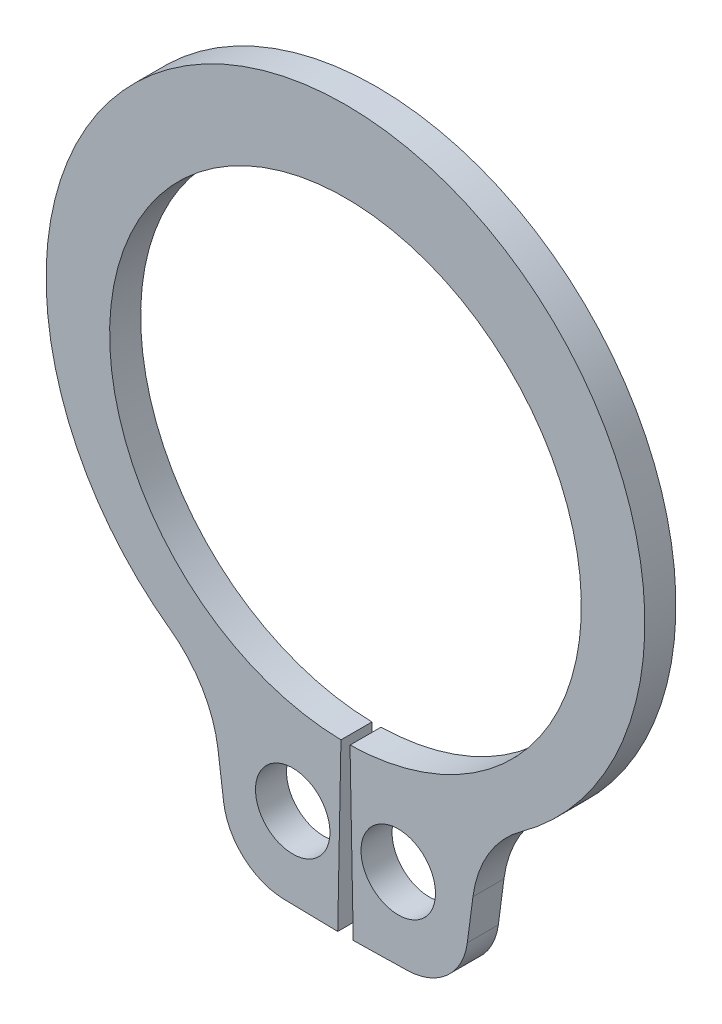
from build123d import *

# Parameters (mm, degrees)
BODYSKE_R  = 0.3
BODY_DEPTH = 0.25


with BuildPart() as part:
    # BodySke → Body (new body)
    with BuildSketch(Plane.XY):
        with BuildLine():
            Line((0.036538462, -1.899648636), (0.0625, -3.249398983))
            Line((0.0625, -3.249398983), (0.495236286, -3.241075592))
            ThreePointArc((0.495236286, -3.241075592), (0.818893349, -3.113900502), (0.981343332, -2.806431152))
            Line((0.981343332, -2.806431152), (1.026638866, -2.462377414))
            ThreePointArc((1.026638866, -2.462377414), (1.152695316, -2.099674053), (1.412082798, -1.816544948))
            ThreePointArc((1.412082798, -1.816544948), (0, 2.55), (-1.412082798, -1.816544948))
            ThreePointArc((-1.412082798, -1.816544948), (-1.152695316, -2.099674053), (-1.026638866, -2.462377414))
            Line((-1.026638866, -2.462377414), (-0.981343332, -2.806431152))
            ThreePointArc((-0.981343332, -2.806431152), (-0.818893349, -3.113900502), (-0.495236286, -3.241075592))
            Line((-0.495236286, -3.241075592), (-0.0625, -3.249398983))
            Line((-0.0625, -3.249398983), (-0.036538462, -1.899648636))
            ThreePointArc((-0.036538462, -1.899648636), (0, 1.9), (0.036538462, -1.899648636))
        make_face()
        with Locations((0.425, -2.590366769)):
            Circle(BODYSKE_R, mode=Mode.SUBTRACT)
        with Locations((-0.425, -2.590366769)):
            Circle(BODYSKE_R, mode=Mode.SUBTRACT)
    extrude(amount=-BODY_DEPTH)


solid = part.part
